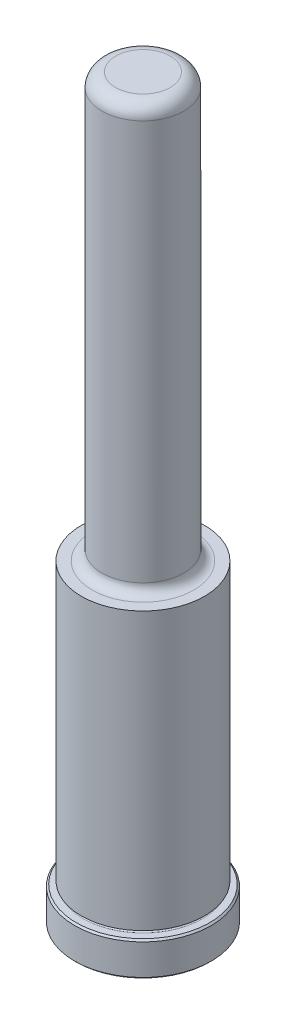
from build123d import *

# Parameters (mm, degrees)
CHAMFER1_SIZE = 0.381
FILLET7_R     = 3.175


with BuildPart() as part:
    # Sketch1 → Revolve1 (revolve)
    with BuildSketch(Plane(origin=(0, 0, 0), x_dir=(0, 0, -1), z_dir=(1, 0, 0)), mode=Mode.PRIVATE) as revolve1_sk:
        with BuildLine():
            Line((0, 0), (15.875, 0))
            Line((15.875, 0), (15.875, 7.9248))
            Line((15.875, 7.9248), (13.8938, 7.9248))
            ThreePointArc((13.8938, 7.9248), (13.5128, 8.3058), (13.8938, 8.6868))
            Line((13.8938, 8.6868), (14.3002, 8.6868))
            Line((14.3002, 8.6868), (14.3002, 73.025))
            Line((14.3002, 73.025), (11.7983, 73.025))
            ThreePointArc((11.7983, 73.025), (10.181853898, 73.694553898), (9.5123, 75.311))
            Line((9.5123, 75.311), (9.5123, 171.45))
            Line((9.5123, 171.45), (0, 171.45))
            Line((0, 171.45), (0, 0))
        make_face()
    revolve(revolve1_sk.sketch.rotate(Axis((0, 0, 0), (0, -1, 0)), 180), axis=Axis((0, 0, 0), (0, -1, 0)))

    # Chamfer1
    chamfer1_edges = [part.edges().sort_by_distance(p)[0] for p in [
        (0, 7.9248, -15.875),
        (0, 0, -15.875),
    ]]
    chamfer(chamfer1_edges, length=CHAMFER1_SIZE)

    # Fillet7
    fillet7_edges = [part.edges().sort_by_distance(p)[0] for p in [
        (0, 171.45, -9.5123),
    ]]
    fillet(fillet7_edges, radius=FILLET7_R)


solid = part.part
